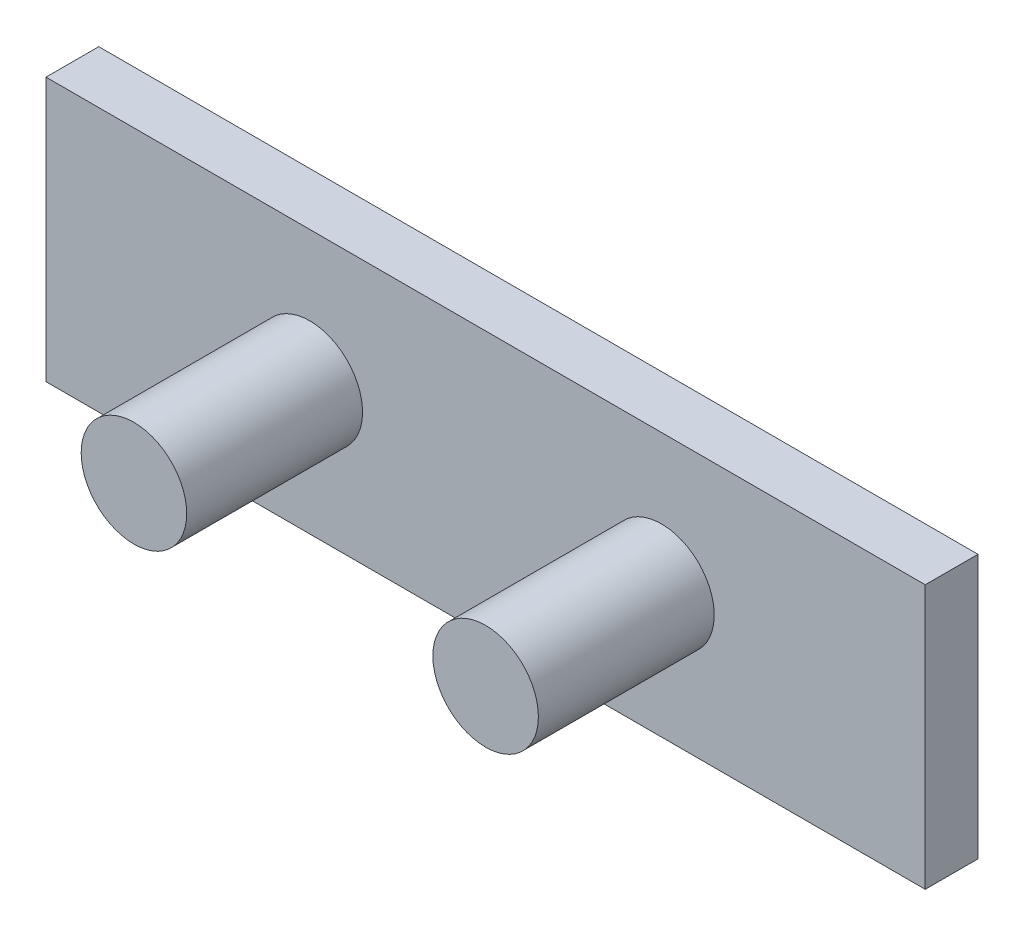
ISO-10303-21;
HEADER;
FILE_DESCRIPTION(('STEP AP214'),'2;1');
FILE_NAME('part.step','',(''),(''),'','','');
FILE_SCHEMA(('AUTOMOTIVE_DESIGN { 1 0 10303 214 1 1 1 1 }'));
ENDSEC;
DATA;
#1=APPLICATION_CONTEXT('core data for automotive mechanical design processes');
#2=APPLICATION_PROTOCOL_DEFINITION('international standard','automotive_design',2000,#1);
#3=PRODUCT_CONTEXT('',#1,'mechanical');
#4=PRODUCT('Part','Part','',(#3));
#5=PRODUCT_RELATED_PRODUCT_CATEGORY('part','',(#4));
#6=PRODUCT_DEFINITION_FORMATION('','',#4);
#7=PRODUCT_DEFINITION_CONTEXT('part definition',#1,'design');
#8=PRODUCT_DEFINITION('design','',#6,#7);
#9=PRODUCT_DEFINITION_SHAPE('','',#8);
#10=(LENGTH_UNIT() NAMED_UNIT(*) SI_UNIT(.MILLI.,.METRE.));
#11=(NAMED_UNIT(*) PLANE_ANGLE_UNIT() SI_UNIT($,.RADIAN.));
#12=(NAMED_UNIT(*) SI_UNIT($,.STERADIAN.) SOLID_ANGLE_UNIT());
#13=UNCERTAINTY_MEASURE_WITH_UNIT(LENGTH_MEASURE(1.E-05),#10,'distance_accuracy_value','');
#14=(GEOMETRIC_REPRESENTATION_CONTEXT(3) GLOBAL_UNCERTAINTY_ASSIGNED_CONTEXT((#13)) GLOBAL_UNIT_ASSIGNED_CONTEXT((#10,
#11,#12)) REPRESENTATION_CONTEXT('',''));
#15=CARTESIAN_POINT('',(0.,0.,0.));
#16=DIRECTION('',(0.,0.,1.));
#17=DIRECTION('',(1.,0.,0.));
#18=AXIS2_PLACEMENT_3D('',#15,#16,#17);
#19=CARTESIAN_POINT('',(0.,15.,3.));
#20=DIRECTION('',(0.,0.,-1.));
#21=DIRECTION('',(-1.,0.,0.));
#22=AXIS2_PLACEMENT_3D('',#19,#20,#21);
#23=PLANE('',#22);
#24=CARTESIAN_POINT('',(15.,7.49999999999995,3.));
#25=DIRECTION('',(0.,0.,-1.));
#26=DIRECTION('',(-1.,0.,0.));
#27=AXIS2_PLACEMENT_3D('',#24,#25,#26);
#28=CIRCLE('',#27,3.);
#29=CARTESIAN_POINT('',(12.,7.49999999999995,3.));
#30=VERTEX_POINT('',#29);
#31=EDGE_CURVE('E37',#30,#30,#28,.F.);
#32=ORIENTED_EDGE('',*,*,#31,.F.);
#33=EDGE_LOOP('',(#32));
#34=FACE_BOUND('',#33,.T.);
#35=DIRECTION('',(0.,-1.,0.));
#36=VECTOR('',#35,1.);
#37=CARTESIAN_POINT('',(0.,0.,3.));
#38=LINE('',#37,#36);
#39=CARTESIAN_POINT('',(0.,15.,3.));
#40=VERTEX_POINT('',#39);
#41=CARTESIAN_POINT('',(0.,0.,3.));
#42=VERTEX_POINT('',#41);
#43=EDGE_CURVE('E101',#40,#42,#38,.T.);
#44=ORIENTED_EDGE('',*,*,#43,.T.);
#45=DIRECTION('',(1.,0.,0.));
#46=VECTOR('',#45,1.);
#47=CARTESIAN_POINT('',(0.,0.,3.));
#48=LINE('',#47,#46);
#49=CARTESIAN_POINT('',(50.,0.,3.));
#50=VERTEX_POINT('',#49);
#51=EDGE_CURVE('E84',#42,#50,#48,.T.);
#52=ORIENTED_EDGE('',*,*,#51,.T.);
#53=DIRECTION('',(0.,1.,0.));
#54=VECTOR('',#53,1.);
#55=CARTESIAN_POINT('',(50.,0.,3.));
#56=LINE('',#55,#54);
#57=CARTESIAN_POINT('',(50.,15.,3.));
#58=VERTEX_POINT('',#57);
#59=EDGE_CURVE('E49',#50,#58,#56,.T.);
#60=ORIENTED_EDGE('',*,*,#59,.T.);
#61=DIRECTION('',(-1.,0.,0.));
#62=VECTOR('',#61,1.);
#63=CARTESIAN_POINT('',(0.,15.,3.));
#64=LINE('',#63,#62);
#65=EDGE_CURVE('E44',#58,#40,#64,.T.);
#66=ORIENTED_EDGE('',*,*,#65,.T.);
#67=EDGE_LOOP('',(#44,#52,#60,#66));
#68=FACE_BOUND('',#67,.T.);
#69=CARTESIAN_POINT('',(35.,7.49999999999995,3.));
#70=DIRECTION('',(0.,0.,-1.));
#71=DIRECTION('',(-1.,0.,0.));
#72=AXIS2_PLACEMENT_3D('',#69,#70,#71);
#73=CIRCLE('',#72,3.);
#74=CARTESIAN_POINT('',(32.,7.49999999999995,3.));
#75=VERTEX_POINT('',#74);
#76=EDGE_CURVE('E11',#75,#75,#73,.F.);
#77=ORIENTED_EDGE('',*,*,#76,.F.);
#78=EDGE_LOOP('',(#77));
#79=FACE_BOUND('',#78,.T.);
#80=ADVANCED_FACE('F29',(#34,#68,#79),#23,.F.);
#81=CARTESIAN_POINT('',(0.,0.,3.));
#82=DIRECTION('',(1.,0.,0.));
#83=DIRECTION('',(0.,0.,-1.));
#84=AXIS2_PLACEMENT_3D('',#81,#82,#83);
#85=PLANE('',#84);
#86=DIRECTION('',(0.,-1.,0.));
#87=VECTOR('',#86,1.);
#88=CARTESIAN_POINT('',(0.,0.,0.));
#89=LINE('',#88,#87);
#90=CARTESIAN_POINT('',(0.,15.,0.));
#91=VERTEX_POINT('',#90);
#92=CARTESIAN_POINT('',(0.,0.,0.));
#93=VERTEX_POINT('',#92);
#94=EDGE_CURVE('E75',#91,#93,#89,.T.);
#95=ORIENTED_EDGE('',*,*,#94,.T.);
#96=DIRECTION('',(0.,0.,-1.));
#97=VECTOR('',#96,1.);
#98=CARTESIAN_POINT('',(0.,0.,3.));
#99=LINE('',#98,#97);
#100=EDGE_CURVE('E82',#42,#93,#99,.T.);
#101=ORIENTED_EDGE('',*,*,#100,.F.);
#102=ORIENTED_EDGE('',*,*,#43,.F.);
#103=DIRECTION('',(0.,0.,-1.));
#104=VECTOR('',#103,1.);
#105=CARTESIAN_POINT('',(0.,15.,3.));
#106=LINE('',#105,#104);
#107=EDGE_CURVE('E90',#40,#91,#106,.T.);
#108=ORIENTED_EDGE('',*,*,#107,.T.);
#109=EDGE_LOOP('',(#95,#101,#102,#108));
#110=FACE_BOUND('',#109,.T.);
#111=ADVANCED_FACE('F31',(#110),#85,.F.);
#112=CARTESIAN_POINT('',(0.,0.,3.));
#113=DIRECTION('',(0.,1.,0.));
#114=DIRECTION('',(0.,0.,1.));
#115=AXIS2_PLACEMENT_3D('',#112,#113,#114);
#116=PLANE('',#115);
#117=DIRECTION('',(1.,0.,0.));
#118=VECTOR('',#117,1.);
#119=CARTESIAN_POINT('',(0.,0.,0.));
#120=LINE('',#119,#118);
#121=CARTESIAN_POINT('',(50.,0.,0.));
#122=VERTEX_POINT('',#121);
#123=EDGE_CURVE('E70',#93,#122,#120,.T.);
#124=ORIENTED_EDGE('',*,*,#123,.T.);
#125=DIRECTION('',(0.,0.,-1.));
#126=VECTOR('',#125,1.);
#127=CARTESIAN_POINT('',(50.,0.,3.));
#128=LINE('',#127,#126);
#129=EDGE_CURVE('E87',#50,#122,#128,.T.);
#130=ORIENTED_EDGE('',*,*,#129,.F.);
#131=ORIENTED_EDGE('',*,*,#51,.F.);
#132=ORIENTED_EDGE('',*,*,#100,.T.);
#133=EDGE_LOOP('',(#124,#130,#131,#132));
#134=FACE_BOUND('',#133,.T.);
#135=ADVANCED_FACE('F83',(#134),#116,.F.);
#136=CARTESIAN_POINT('',(50.,0.,3.));
#137=DIRECTION('',(-1.,0.,0.));
#138=DIRECTION('',(0.,0.,1.));
#139=AXIS2_PLACEMENT_3D('',#136,#137,#138);
#140=PLANE('',#139);
#141=DIRECTION('',(0.,1.,0.));
#142=VECTOR('',#141,1.);
#143=CARTESIAN_POINT('',(50.,0.,0.));
#144=LINE('',#143,#142);
#145=CARTESIAN_POINT('',(50.,15.,0.));
#146=VERTEX_POINT('',#145);
#147=EDGE_CURVE('E76',#122,#146,#144,.T.);
#148=ORIENTED_EDGE('',*,*,#147,.T.);
#149=DIRECTION('',(0.,0.,-1.));
#150=VECTOR('',#149,1.);
#151=CARTESIAN_POINT('',(50.,15.,3.));
#152=LINE('',#151,#150);
#153=EDGE_CURVE('E107',#58,#146,#152,.T.);
#154=ORIENTED_EDGE('',*,*,#153,.F.);
#155=ORIENTED_EDGE('',*,*,#59,.F.);
#156=ORIENTED_EDGE('',*,*,#129,.T.);
#157=EDGE_LOOP('',(#148,#154,#155,#156));
#158=FACE_BOUND('',#157,.T.);
#159=ADVANCED_FACE('F144',(#158),#140,.F.);
#160=CARTESIAN_POINT('',(0.,15.,3.));
#161=DIRECTION('',(0.,-1.,0.));
#162=DIRECTION('',(0.,0.,-1.));
#163=AXIS2_PLACEMENT_3D('',#160,#161,#162);
#164=PLANE('',#163);
#165=DIRECTION('',(-1.,0.,0.));
#166=VECTOR('',#165,1.);
#167=CARTESIAN_POINT('',(0.,15.,0.));
#168=LINE('',#167,#166);
#169=EDGE_CURVE('E99',#146,#91,#168,.T.);
#170=ORIENTED_EDGE('',*,*,#169,.T.);
#171=ORIENTED_EDGE('',*,*,#107,.F.);
#172=ORIENTED_EDGE('',*,*,#65,.F.);
#173=ORIENTED_EDGE('',*,*,#153,.T.);
#174=EDGE_LOOP('',(#170,#171,#172,#173));
#175=FACE_BOUND('',#174,.T.);
#176=ADVANCED_FACE('F140',(#175),#164,.F.);
#177=CARTESIAN_POINT('',(0.,15.,0.));
#178=DIRECTION('',(0.,0.,-1.));
#179=DIRECTION('',(-1.,0.,0.));
#180=AXIS2_PLACEMENT_3D('',#177,#178,#179);
#181=PLANE('',#180);
#182=ORIENTED_EDGE('',*,*,#94,.F.);
#183=ORIENTED_EDGE('',*,*,#169,.F.);
#184=ORIENTED_EDGE('',*,*,#147,.F.);
#185=ORIENTED_EDGE('',*,*,#123,.F.);
#186=EDGE_LOOP('',(#182,#183,#184,#185));
#187=FACE_BOUND('',#186,.T.);
#188=ADVANCED_FACE('F72',(#187),#181,.T.);
#189=CARTESIAN_POINT('',(15.,7.49999999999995,13.));
#190=DIRECTION('',(0.,0.,-1.));
#191=DIRECTION('',(-1.,0.,0.));
#192=AXIS2_PLACEMENT_3D('',#189,#190,#191);
#193=CYLINDRICAL_SURFACE('',#192,3.);
#194=CARTESIAN_POINT('',(15.,7.49999999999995,13.));
#195=DIRECTION('',(0.,0.,1.));
#196=DIRECTION('',(1.,0.,0.));
#197=AXIS2_PLACEMENT_3D('',#194,#195,#196);
#198=CIRCLE('',#197,3.);
#199=CARTESIAN_POINT('',(18.,7.49999999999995,13.));
#200=VERTEX_POINT('',#199);
#201=EDGE_CURVE('E91',#200,#200,#198,.T.);
#202=ORIENTED_EDGE('',*,*,#201,.F.);
#203=EDGE_LOOP('',(#202));
#204=FACE_BOUND('',#203,.T.);
#205=ORIENTED_EDGE('',*,*,#31,.T.);
#206=EDGE_LOOP('',(#205));
#207=FACE_BOUND('',#206,.T.);
#208=ADVANCED_FACE('F113',(#204,#207),#193,.T.);
#209=CARTESIAN_POINT('',(15.,7.49999999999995,13.));
#210=DIRECTION('',(0.,0.,1.));
#211=DIRECTION('',(1.,0.,0.));
#212=AXIS2_PLACEMENT_3D('',#209,#210,#211);
#213=PLANE('',#212);
#214=ORIENTED_EDGE('',*,*,#201,.T.);
#215=EDGE_LOOP('',(#214));
#216=FACE_BOUND('',#215,.T.);
#217=ADVANCED_FACE('F123',(#216),#213,.T.);
#218=CARTESIAN_POINT('',(35.,7.49999999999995,13.));
#219=DIRECTION('',(0.,0.,-1.));
#220=DIRECTION('',(-1.,0.,0.));
#221=AXIS2_PLACEMENT_3D('',#218,#219,#220);
#222=CYLINDRICAL_SURFACE('',#221,3.);
#223=CARTESIAN_POINT('',(35.,7.49999999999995,13.));
#224=DIRECTION('',(0.,0.,1.));
#225=DIRECTION('',(1.,0.,0.));
#226=AXIS2_PLACEMENT_3D('',#223,#224,#225);
#227=CIRCLE('',#226,3.);
#228=CARTESIAN_POINT('',(38.,7.49999999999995,13.));
#229=VERTEX_POINT('',#228);
#230=EDGE_CURVE('E94',#229,#229,#227,.T.);
#231=ORIENTED_EDGE('',*,*,#230,.F.);
#232=EDGE_LOOP('',(#231));
#233=FACE_BOUND('',#232,.T.);
#234=ORIENTED_EDGE('',*,*,#76,.T.);
#235=EDGE_LOOP('',(#234));
#236=FACE_BOUND('',#235,.T.);
#237=ADVANCED_FACE('F120',(#233,#236),#222,.T.);
#238=CARTESIAN_POINT('',(35.,7.49999999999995,13.));
#239=DIRECTION('',(0.,0.,1.));
#240=DIRECTION('',(1.,0.,0.));
#241=AXIS2_PLACEMENT_3D('',#238,#239,#240);
#242=PLANE('',#241);
#243=ORIENTED_EDGE('',*,*,#230,.T.);
#244=EDGE_LOOP('',(#243));
#245=FACE_BOUND('',#244,.T.);
#246=ADVANCED_FACE('F122',(#245),#242,.T.);
#247=CLOSED_SHELL('',(#80,#111,#135,#159,#176,#188,#208,#217,#237,#246));
#248=MANIFOLD_SOLID_BREP('B2',#247);
#249=ADVANCED_BREP_SHAPE_REPRESENTATION('',(#18,#248),#14);
#250=SHAPE_DEFINITION_REPRESENTATION(#9,#249);
ENDSEC;
END-ISO-10303-21;
